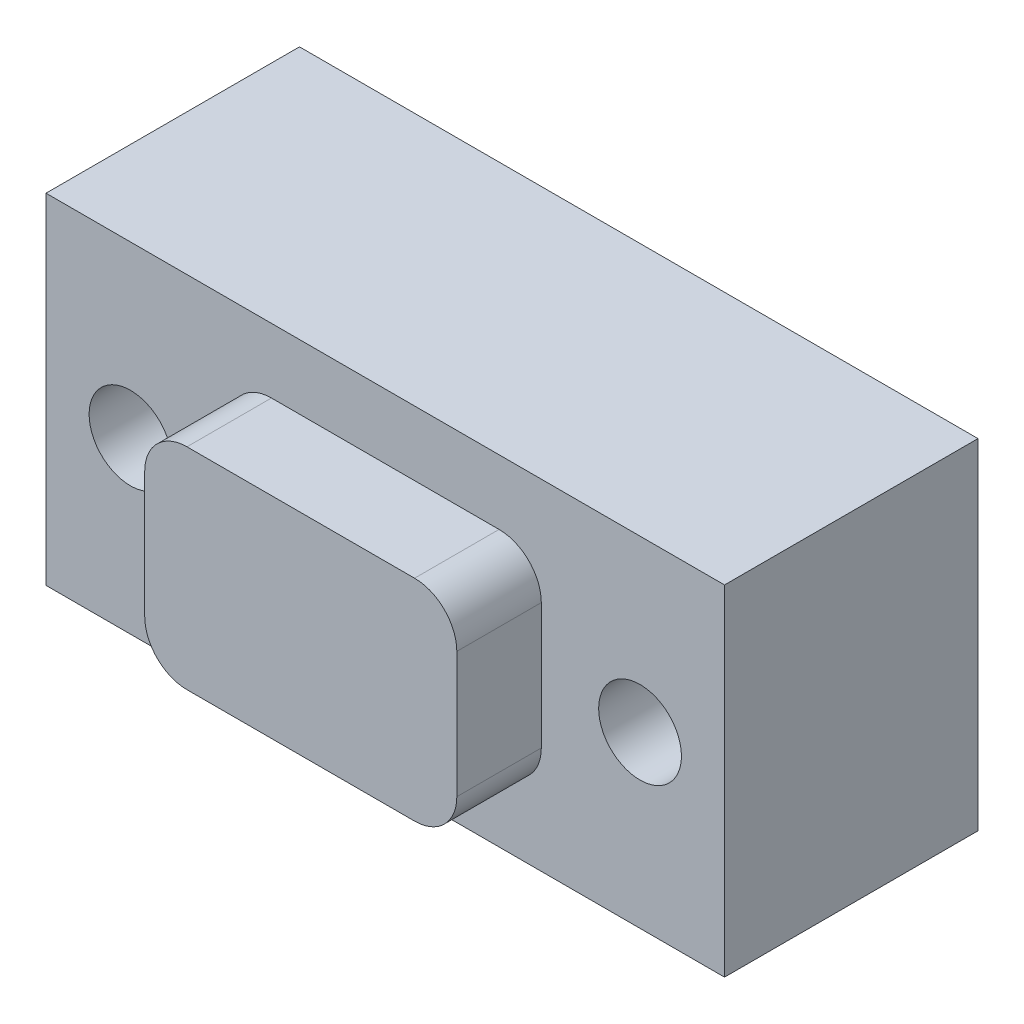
from build123d import *

# Parameters (mm, degrees)
SKETCH1_W             = 19.9898
SKETCH1_H             = 10.0076
BOSS_EXTRUDE1_DEPTH   = 7.4676
BOSS_EXTRUDE2_DEPTH   = 2.4892
F_2_CLEARANCE_HOLE1_D = 2.4384


with BuildPart() as part:
    # Sketch1 → Boss-Extrude1 (new body)
    with BuildSketch(Plane.XY):
        Rectangle(SKETCH1_W, SKETCH1_H)
    extrude(amount=-BOSS_EXTRUDE1_DEPTH)

    # Sketch2 → Boss-Extrude2 (add)
    with BuildSketch(Plane.XY):
        with BuildLine():
            Line((-3.3528, -3.0988), (3.3528, -3.0988))
            ThreePointArc((3.3528, -3.0988), (4.2328651, -2.7342651), (4.5974, -1.8542))
            Line((4.5974, -1.8542), (4.5974, 1.8542))
            ThreePointArc((4.5974, 1.8542), (4.2328651, 2.7342651), (3.3528, 3.0988))
            Line((3.3528, 3.0988), (-3.3528, 3.0988))
            ThreePointArc((-3.3528, 3.0988), (-4.2328651, 2.7342651), (-4.5974, 1.8542))
            Line((-4.5974, 1.8542), (-4.5974, -1.8542))
            ThreePointArc((-4.5974, -1.8542), (-4.2328651, -2.7342651), (-3.3528, -3.0988))
        make_face()
    extrude(amount=BOSS_EXTRUDE2_DEPTH)

    # 2 Clearance Hole1 (through all)
    with Locations(Plane(origin=(0, 0, -7.4676), x_dir=(-1, 0, 0), z_dir=(0, 0, -1))):
        with Locations((-7.5057, 0), (7.5057, 0)):
            Hole(F_2_CLEARANCE_HOLE1_D / 2)


solid = part.part
